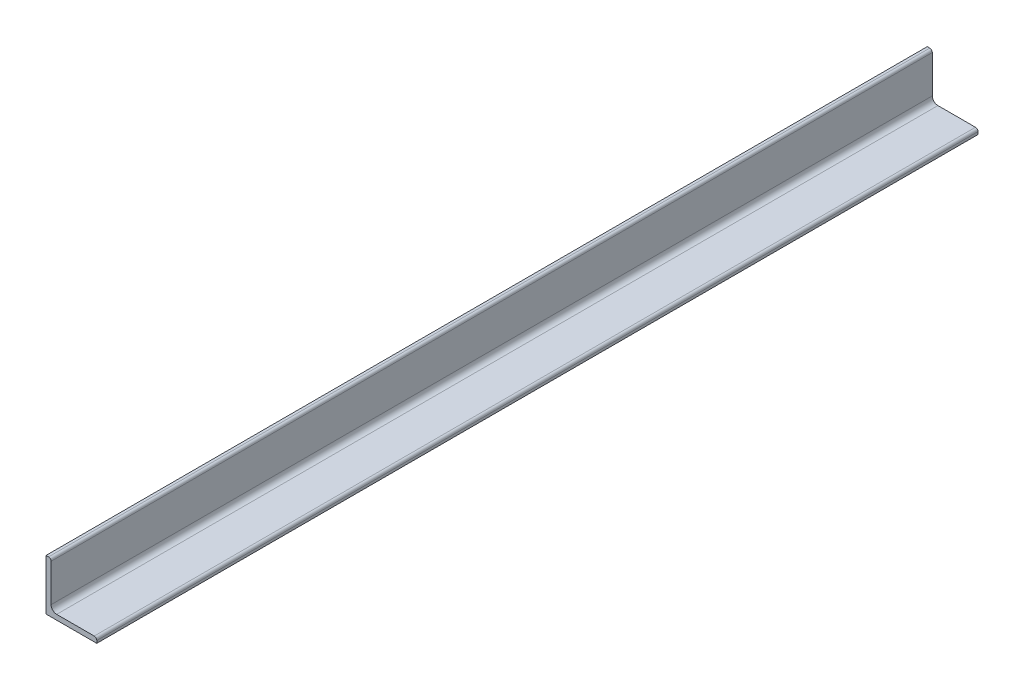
from build123d import *

# Parameters (mm, degrees)
EXTRUDE_1_DEPTH = 868


with BuildPart() as part:
    # Sketch 1 → Extrude 1 (new body)
    with BuildSketch(Plane.XY):
        with BuildLine():
            Line((0, 50), (0, 0))
            Line((0, 0), (50, 0))
            Line((50, 0), (50, 2.5))
            ThreePointArc((50, 2.5), (49.267766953, 4.267766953), (47.5, 5))
            Line((47.5, 5), (10.5, 5))
            ThreePointArc((10.5, 5), (6.610912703, 6.610912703), (5, 10.5))
            Line((5, 10.5), (5, 47.5))
            ThreePointArc((5, 47.5), (4.267766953, 49.267766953), (2.5, 50))
            Line((2.5, 50), (0, 50))
        make_face()
    extrude(amount=EXTRUDE_1_DEPTH)


solid = part.part
